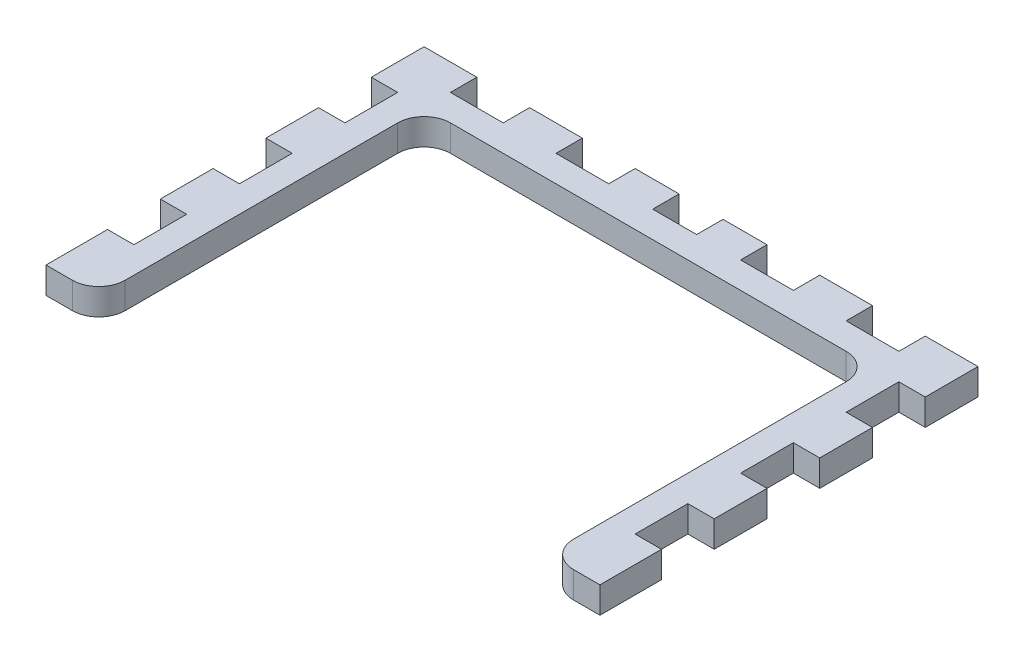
from build123d import *

# Parameters (mm, degrees)
SKETCH1_W           = 63
SKETCH1_H           = 43
BOSS_EXTRUDE1_DEPTH = 3
SKETCH2_W           = 51
SKETCH2_H           = 37
CUT_EXTRUDE1_DEPTH  = 10
FILLET1_R           = 3
FILLET2_R           = 3
SKETCH3_W           = 3
SKETCH3_H           = 6
CUT_EXTRUDE2_DEPTH  = 10
SKETCH5_W           = 6
SKETCH5_H           = 3
CUT_EXTRUDE3_DEPTH  = 10
SKETCH6_W           = 5
SKETCH6_H           = 3
CUT_EXTRUDE4_DEPTH  = 10


with BuildPart() as part:
    # Sketch1 → Boss-Extrude1 (new body)
    with BuildSketch(Plane(origin=(0, 0, 0), x_dir=(1, 0, 0), z_dir=(0, 1, 0))):
        Rectangle(SKETCH1_W, SKETCH1_H)
    extrude(amount=BOSS_EXTRUDE1_DEPTH)

    # Sketch2 → Cut-Extrude1 (cut)
    with BuildSketch(Plane(origin=(0, 3, 0), x_dir=(-1, 0, 0), z_dir=(0, 1, 0))):
        with Locations((0, 3)):
            Rectangle(SKETCH2_W, SKETCH2_H)
    extrude(amount=-CUT_EXTRUDE1_DEPTH, mode=Mode.SUBTRACT)

    # Fillet1
    fillet1_edges = [part.edges().sort_by_distance(p)[0] for p in [
        (25.5, 1.5, 21.5),
        (-25.5, 1.5, 21.5),
    ]]
    fillet(fillet1_edges, radius=FILLET1_R)

    # Fillet2
    fillet2_edges = [part.edges().sort_by_distance(p)[0] for p in [
        (25.5, 1.5, -15.5),
        (-25.5, 1.5, -15.5),
    ]]
    fillet(fillet2_edges, radius=FILLET2_R)

    # Sketch3 → Cut-Extrude2 (cut)
    with BuildSketch(Plane(origin=(0, 3, 0), x_dir=(1, 0, 0), z_dir=(0, 1, 0))):
        with Locations((-30, 12.5)):
            Rectangle(SKETCH3_W, SKETCH3_H)
        with Locations((-30, 0.5)):
            Rectangle(SKETCH3_W, SKETCH3_H)
        with Locations((-30, -11.5)):
            Rectangle(SKETCH3_W, SKETCH3_H)
    cut_extrude2 = extrude(amount=-CUT_EXTRUDE2_DEPTH, mode=Mode.SUBTRACT)

    # Sketch5 → Cut-Extrude3 (cut)
    with BuildSketch(Plane(origin=(0, 3, 0), x_dir=(1, 0, 0), z_dir=(0, 1, 0))):
        with Locations((-22.5, 20)):
            Rectangle(SKETCH5_W, SKETCH5_H)
        with Locations((-10.5, 20)):
            Rectangle(SKETCH5_W, SKETCH5_H)
    cut_extrude3 = extrude(amount=-CUT_EXTRUDE3_DEPTH, mode=Mode.SUBTRACT)

    # Mirror1: Cut-Extrude2, Cut-Extrude3 across plane
    add(cut_extrude2.mirror(Plane(origin=(0, 0, 0), x_dir=(0, 0, 1), z_dir=(1, 0, 0))), mode=Mode.SUBTRACT)
    add(cut_extrude3.mirror(Plane(origin=(0, 0, 0), x_dir=(0, 0, 1), z_dir=(1, 0, 0))), mode=Mode.SUBTRACT)

    # Sketch6 → Cut-Extrude4 (cut)
    with BuildSketch(Plane(origin=(0, 3, 0), x_dir=(1, 0, 0), z_dir=(0, 1, 0))):
        with Locations((0, 20)):
            Rectangle(SKETCH6_W, SKETCH6_H)
    extrude(amount=-CUT_EXTRUDE4_DEPTH, mode=Mode.SUBTRACT)


solid = part.part
